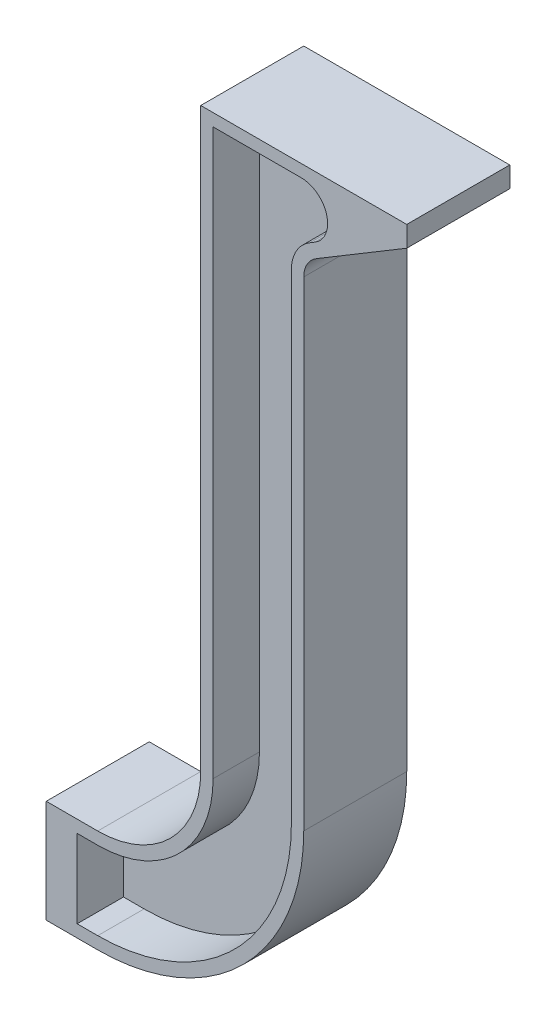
ISO-10303-21;
HEADER;
FILE_DESCRIPTION(('STEP AP214'),'2;1');
FILE_NAME('part.step','',(''),(''),'','','');
FILE_SCHEMA(('AUTOMOTIVE_DESIGN { 1 0 10303 214 1 1 1 1 }'));
ENDSEC;
DATA;
#1=APPLICATION_CONTEXT('core data for automotive mechanical design processes');
#2=APPLICATION_PROTOCOL_DEFINITION('international standard','automotive_design',2000,#1);
#3=PRODUCT_CONTEXT('',#1,'mechanical');
#4=PRODUCT('Part','Part','',(#3));
#5=PRODUCT_RELATED_PRODUCT_CATEGORY('part','',(#4));
#6=PRODUCT_DEFINITION_FORMATION('','',#4);
#7=PRODUCT_DEFINITION_CONTEXT('part definition',#1,'design');
#8=PRODUCT_DEFINITION('design','',#6,#7);
#9=PRODUCT_DEFINITION_SHAPE('','',#8);
#10=(LENGTH_UNIT() NAMED_UNIT(*) SI_UNIT(.MILLI.,.METRE.));
#11=(NAMED_UNIT(*) PLANE_ANGLE_UNIT() SI_UNIT($,.RADIAN.));
#12=(NAMED_UNIT(*) SI_UNIT($,.STERADIAN.) SOLID_ANGLE_UNIT());
#13=UNCERTAINTY_MEASURE_WITH_UNIT(LENGTH_MEASURE(1.E-05),#10,'distance_accuracy_value','');
#14=(GEOMETRIC_REPRESENTATION_CONTEXT(3) GLOBAL_UNCERTAINTY_ASSIGNED_CONTEXT((#13)) GLOBAL_UNIT_ASSIGNED_CONTEXT((#10,
#11,#12)) REPRESENTATION_CONTEXT('',''));
#15=CARTESIAN_POINT('',(0.,0.,0.));
#16=DIRECTION('',(0.,0.,1.));
#17=DIRECTION('',(1.,0.,0.));
#18=AXIS2_PLACEMENT_3D('',#15,#16,#17);
#19=CARTESIAN_POINT('',(15.875,-11.9576544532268,-6.35));
#20=DIRECTION('',(0.,0.,1.));
#21=DIRECTION('',(1.,0.,0.));
#22=AXIS2_PLACEMENT_3D('',#19,#20,#21);
#23=PLANE('',#22);
#24=DIRECTION('',(0.,1.,0.));
#25=VECTOR('',#24,1.);
#26=CARTESIAN_POINT('',(25.4,0.,-6.35));
#27=LINE('',#26,#25);
#28=CARTESIAN_POINT('',(25.4,-2.54,-6.35));
#29=VERTEX_POINT('',#28);
#30=CARTESIAN_POINT('',(25.4,0.,-6.35));
#31=VERTEX_POINT('',#30);
#32=EDGE_CURVE('E404',#29,#31,#27,.T.);
#33=ORIENTED_EDGE('',*,*,#32,.F.);
#34=DIRECTION('',(0.857492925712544,0.514495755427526,0.));
#35=VECTOR('',#34,1.);
#36=CARTESIAN_POINT('',(14.2414759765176,-9.23511441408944,-6.35));
#37=LINE('',#36,#35);
#38=CARTESIAN_POINT('',(14.2414759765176,-9.23511441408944,-6.35));
#39=VERTEX_POINT('',#38);
#40=EDGE_CURVE('E409',#39,#29,#37,.T.);
#41=ORIENTED_EDGE('',*,*,#40,.F.);
#42=CARTESIAN_POINT('',(15.875,-11.9576544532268,-6.35));
#43=DIRECTION('',(0.,0.,-1.));
#44=DIRECTION('',(1.,0.,0.));
#45=AXIS2_PLACEMENT_3D('',#42,#43,#44);
#46=CIRCLE('',#45,3.175);
#47=CARTESIAN_POINT('',(12.7,-11.9576544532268,-6.35));
#48=VERTEX_POINT('',#47);
#49=EDGE_CURVE('E448',#48,#39,#46,.T.);
#50=ORIENTED_EDGE('',*,*,#49,.F.);
#51=DIRECTION('',(0.,1.,0.));
#52=VECTOR('',#51,1.);
#53=CARTESIAN_POINT('',(12.7,-11.9576544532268,-6.35));
#54=LINE('',#53,#52);
#55=CARTESIAN_POINT('',(12.7,-71.12,-6.35));
#56=VERTEX_POINT('',#55);
#57=EDGE_CURVE('E446',#56,#48,#54,.T.);
#58=ORIENTED_EDGE('',*,*,#57,.F.);
#59=CARTESIAN_POINT('',(-12.7,-71.12,-6.35));
#60=DIRECTION('',(0.,0.,1.));
#61=DIRECTION('',(-1.,0.,0.));
#62=AXIS2_PLACEMENT_3D('',#59,#60,#61);
#63=CIRCLE('',#62,25.4);
#64=CARTESIAN_POINT('',(-12.7,-96.52,-6.35));
#65=VERTEX_POINT('',#64);
#66=EDGE_CURVE('E444',#65,#56,#63,.T.);
#67=ORIENTED_EDGE('',*,*,#66,.F.);
#68=DIRECTION('',(1.,0.,0.));
#69=VECTOR('',#68,1.);
#70=CARTESIAN_POINT('',(-12.7,-96.52,-6.35));
#71=LINE('',#70,#69);
#72=CARTESIAN_POINT('',(-19.05,-96.52,-6.35));
#73=VERTEX_POINT('',#72);
#74=EDGE_CURVE('E442',#73,#65,#71,.T.);
#75=ORIENTED_EDGE('',*,*,#74,.F.);
#76=DIRECTION('',(0.,-1.,0.));
#77=VECTOR('',#76,1.);
#78=CARTESIAN_POINT('',(-19.05,-96.52,-6.35));
#79=LINE('',#78,#77);
#80=CARTESIAN_POINT('',(-19.05,-83.82,-6.35));
#81=VERTEX_POINT('',#80);
#82=EDGE_CURVE('E440',#81,#73,#79,.T.);
#83=ORIENTED_EDGE('',*,*,#82,.F.);
#84=DIRECTION('',(-1.,0.,0.));
#85=VECTOR('',#84,1.);
#86=CARTESIAN_POINT('',(-12.7,-83.82,-6.35));
#87=LINE('',#86,#85);
#88=CARTESIAN_POINT('',(-12.7,-83.82,-6.35));
#89=VERTEX_POINT('',#88);
#90=EDGE_CURVE('E438',#89,#81,#87,.T.);
#91=ORIENTED_EDGE('',*,*,#90,.F.);
#92=CARTESIAN_POINT('',(-12.7,-71.12,-6.35));
#93=DIRECTION('',(0.,0.,-1.));
#94=DIRECTION('',(-1.,0.,0.));
#95=AXIS2_PLACEMENT_3D('',#92,#93,#94);
#96=CIRCLE('',#95,12.7);
#97=CARTESIAN_POINT('',(0.,-71.12,-6.35));
#98=VERTEX_POINT('',#97);
#99=EDGE_CURVE('E436',#98,#89,#96,.T.);
#100=ORIENTED_EDGE('',*,*,#99,.F.);
#101=DIRECTION('',(0.,-1.,0.));
#102=VECTOR('',#101,1.);
#103=CARTESIAN_POINT('',(0.,0.,-6.35));
#104=LINE('',#103,#102);
#105=CARTESIAN_POINT('',(0.,0.,-6.35));
#106=VERTEX_POINT('',#105);
#107=EDGE_CURVE('E434',#106,#98,#104,.T.);
#108=ORIENTED_EDGE('',*,*,#107,.F.);
#109=DIRECTION('',(-1.,0.,0.));
#110=VECTOR('',#109,1.);
#111=CARTESIAN_POINT('',(0.,0.,-6.35));
#112=LINE('',#111,#110);
#113=EDGE_CURVE('E432',#31,#106,#112,.T.);
#114=ORIENTED_EDGE('',*,*,#113,.F.);
#115=EDGE_LOOP('',(#33,#41,#50,#58,#67,#75,#83,#91,#100,#108,#114));
#116=FACE_BOUND('',#115,.T.);
#117=CARTESIAN_POINT('',(12.3933461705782,-4.7752,-6.35));
#118=DIRECTION('',(0.,0.,1.));
#119=DIRECTION('',(-1.,0.,0.));
#120=AXIS2_PLACEMENT_3D('',#117,#118,#119);
#121=CIRCLE('',#120,3.2512);
#122=CARTESIAN_POINT('',(14.0660747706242,-7.56308100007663,-6.35));
#123=VERTEX_POINT('',#122);
#124=CARTESIAN_POINT('',(12.3933461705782,-1.524,-6.35));
#125=VERTEX_POINT('',#124);
#126=EDGE_CURVE('E50',#123,#125,#121,.T.);
#127=ORIENTED_EDGE('',*,*,#126,.T.);
#128=DIRECTION('',(-1.,0.,0.));
#129=VECTOR('',#128,1.);
#130=CARTESIAN_POINT('',(12.3933461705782,-1.524,-6.35));
#131=LINE('',#130,#129);
#132=CARTESIAN_POINT('',(1.524,-1.524,-6.35));
#133=VERTEX_POINT('',#132);
#134=EDGE_CURVE('E306',#125,#133,#131,.T.);
#135=ORIENTED_EDGE('',*,*,#134,.T.);
#136=DIRECTION('',(0.,-1.,0.));
#137=VECTOR('',#136,1.);
#138=CARTESIAN_POINT('',(1.524,-1.524,-6.35));
#139=LINE('',#138,#137);
#140=CARTESIAN_POINT('',(1.52400000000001,-71.12,-6.35));
#141=VERTEX_POINT('',#140);
#142=EDGE_CURVE('E309',#133,#141,#139,.T.);
#143=ORIENTED_EDGE('',*,*,#142,.T.);
#144=CARTESIAN_POINT('',(-12.7,-71.12,-6.35));
#145=DIRECTION('',(0.,0.,-1.));
#146=DIRECTION('',(1.,0.,0.));
#147=AXIS2_PLACEMENT_3D('',#144,#145,#146);
#148=CIRCLE('',#147,14.224);
#149=CARTESIAN_POINT('',(-12.7,-85.344,-6.35));
#150=VERTEX_POINT('',#149);
#151=EDGE_CURVE('E312',#141,#150,#148,.T.);
#152=ORIENTED_EDGE('',*,*,#151,.T.);
#153=DIRECTION('',(-1.,0.,0.));
#154=VECTOR('',#153,1.);
#155=CARTESIAN_POINT('',(-12.7,-85.344,-6.35));
#156=LINE('',#155,#154);
#157=CARTESIAN_POINT('',(-15.24,-85.344,-6.35));
#158=VERTEX_POINT('',#157);
#159=EDGE_CURVE('E315',#150,#158,#156,.T.);
#160=ORIENTED_EDGE('',*,*,#159,.T.);
#161=DIRECTION('',(0.,-1.,0.));
#162=VECTOR('',#161,1.);
#163=CARTESIAN_POINT('',(-15.24,-85.344,-6.35));
#164=LINE('',#163,#162);
#165=CARTESIAN_POINT('',(-15.24,-94.996,-6.35));
#166=VERTEX_POINT('',#165);
#167=EDGE_CURVE('E318',#158,#166,#164,.T.);
#168=ORIENTED_EDGE('',*,*,#167,.T.);
#169=DIRECTION('',(1.,0.,0.));
#170=VECTOR('',#169,1.);
#171=CARTESIAN_POINT('',(-15.24,-94.996,-6.35));
#172=LINE('',#171,#170);
#173=CARTESIAN_POINT('',(-12.7,-94.996,-6.35));
#174=VERTEX_POINT('',#173);
#175=EDGE_CURVE('E321',#166,#174,#172,.T.);
#176=ORIENTED_EDGE('',*,*,#175,.T.);
#177=CARTESIAN_POINT('',(-12.7,-71.12,-6.35));
#178=DIRECTION('',(0.,0.,1.));
#179=DIRECTION('',(1.,0.,0.));
#180=AXIS2_PLACEMENT_3D('',#177,#178,#179);
#181=CIRCLE('',#180,23.876);
#182=CARTESIAN_POINT('',(11.176,-71.12,-6.35));
#183=VERTEX_POINT('',#182);
#184=EDGE_CURVE('E324',#174,#183,#181,.T.);
#185=ORIENTED_EDGE('',*,*,#184,.T.);
#186=DIRECTION('',(0.,1.,0.));
#187=VECTOR('',#186,1.);
#188=CARTESIAN_POINT('',(11.176,-71.12,-6.35));
#189=LINE('',#188,#187);
#190=CARTESIAN_POINT('',(11.176,-11.9576544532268,-6.35));
#191=VERTEX_POINT('',#190);
#192=EDGE_CURVE('E327',#183,#191,#189,.T.);
#193=ORIENTED_EDGE('',*,*,#192,.T.);
#194=CARTESIAN_POINT('',(15.875,-11.9576544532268,-6.35));
#195=DIRECTION('',(0.,0.,-1.));
#196=DIRECTION('',(1.,0.,0.));
#197=AXIS2_PLACEMENT_3D('',#194,#195,#196);
#198=CIRCLE('',#197,4.699);
#199=CARTESIAN_POINT('',(13.4573844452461,-7.92829519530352,-6.35));
#200=VERTEX_POINT('',#199);
#201=EDGE_CURVE('E261',#191,#200,#198,.T.);
#202=ORIENTED_EDGE('',*,*,#201,.T.);
#203=DIRECTION('',(0.857492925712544,0.514495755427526,0.));
#204=VECTOR('',#203,1.);
#205=CARTESIAN_POINT('',(13.4573844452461,-7.92829519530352,-6.35));
#206=LINE('',#205,#204);
#207=EDGE_CURVE('E256',#200,#123,#206,.T.);
#208=ORIENTED_EDGE('',*,*,#207,.T.);
#209=EDGE_LOOP('',(#127,#135,#143,#152,#160,#168,#176,#185,#193,#202,#208));
#210=FACE_BOUND('',#209,.T.);
#211=ADVANCED_FACE('F35',(#116,#210),#23,.F.);
#212=CARTESIAN_POINT('',(25.4,0.,6.35));
#213=DIRECTION('',(-1.,0.,0.));
#214=DIRECTION('',(0.,0.,1.));
#215=AXIS2_PLACEMENT_3D('',#212,#213,#214);
#216=PLANE('',#215);
#217=ORIENTED_EDGE('',*,*,#32,.T.);
#218=DIRECTION('',(0.,0.,-1.));
#219=VECTOR('',#218,1.);
#220=CARTESIAN_POINT('',(25.4,0.,6.35));
#221=LINE('',#220,#219);
#222=CARTESIAN_POINT('',(25.4,0.,6.35));
#223=VERTEX_POINT('',#222);
#224=EDGE_CURVE('E12',#223,#31,#221,.T.);
#225=ORIENTED_EDGE('',*,*,#224,.F.);
#226=DIRECTION('',(0.,1.,0.));
#227=VECTOR('',#226,1.);
#228=CARTESIAN_POINT('',(25.4,0.,6.35));
#229=LINE('',#228,#227);
#230=CARTESIAN_POINT('',(25.4,-2.54,6.35));
#231=VERTEX_POINT('',#230);
#232=EDGE_CURVE('E405',#231,#223,#229,.T.);
#233=ORIENTED_EDGE('',*,*,#232,.F.);
#234=DIRECTION('',(0.,0.,-1.));
#235=VECTOR('',#234,1.);
#236=CARTESIAN_POINT('',(25.4,-2.54,6.35));
#237=LINE('',#236,#235);
#238=EDGE_CURVE('E429',#231,#29,#237,.T.);
#239=ORIENTED_EDGE('',*,*,#238,.T.);
#240=EDGE_LOOP('',(#217,#225,#233,#239));
#241=FACE_BOUND('',#240,.T.);
#242=ADVANCED_FACE('F37',(#241),#216,.F.);
#243=CARTESIAN_POINT('',(0.,0.,6.35));
#244=DIRECTION('',(0.,-1.,0.));
#245=DIRECTION('',(0.,0.,-1.));
#246=AXIS2_PLACEMENT_3D('',#243,#244,#245);
#247=PLANE('',#246);
#248=ORIENTED_EDGE('',*,*,#113,.T.);
#249=DIRECTION('',(0.,0.,-1.));
#250=VECTOR('',#249,1.);
#251=CARTESIAN_POINT('',(0.,0.,6.35));
#252=LINE('',#251,#250);
#253=CARTESIAN_POINT('',(0.,0.,6.35));
#254=VERTEX_POINT('',#253);
#255=EDGE_CURVE('E43',#254,#106,#252,.T.);
#256=ORIENTED_EDGE('',*,*,#255,.F.);
#257=DIRECTION('',(-1.,0.,0.));
#258=VECTOR('',#257,1.);
#259=CARTESIAN_POINT('',(0.,0.,6.35));
#260=LINE('',#259,#258);
#261=EDGE_CURVE('E408',#223,#254,#260,.T.);
#262=ORIENTED_EDGE('',*,*,#261,.F.);
#263=ORIENTED_EDGE('',*,*,#224,.T.);
#264=EDGE_LOOP('',(#248,#256,#262,#263));
#265=FACE_BOUND('',#264,.T.);
#266=ADVANCED_FACE('F504',(#265),#247,.F.);
#267=CARTESIAN_POINT('',(0.,0.,6.35));
#268=DIRECTION('',(1.,0.,0.));
#269=DIRECTION('',(0.,1.,0.));
#270=AXIS2_PLACEMENT_3D('',#267,#268,#269);
#271=PLANE('',#270);
#272=ORIENTED_EDGE('',*,*,#107,.T.);
#273=DIRECTION('',(0.,0.,-1.));
#274=VECTOR('',#273,1.);
#275=CARTESIAN_POINT('',(0.,-71.12,6.35));
#276=LINE('',#275,#274);
#277=CARTESIAN_POINT('',(0.,-71.12,6.35));
#278=VERTEX_POINT('',#277);
#279=EDGE_CURVE('E474',#278,#98,#276,.T.);
#280=ORIENTED_EDGE('',*,*,#279,.F.);
#281=DIRECTION('',(0.,-1.,0.));
#282=VECTOR('',#281,1.);
#283=CARTESIAN_POINT('',(0.,0.,6.35));
#284=LINE('',#283,#282);
#285=EDGE_CURVE('E411',#254,#278,#284,.T.);
#286=ORIENTED_EDGE('',*,*,#285,.F.);
#287=ORIENTED_EDGE('',*,*,#255,.T.);
#288=EDGE_LOOP('',(#272,#280,#286,#287));
#289=FACE_BOUND('',#288,.T.);
#290=ADVANCED_FACE('F481',(#289),#271,.F.);
#291=CARTESIAN_POINT('',(-12.7,-71.12,6.35));
#292=DIRECTION('',(0.,0.,-1.));
#293=DIRECTION('',(-1.,0.,0.));
#294=AXIS2_PLACEMENT_3D('',#291,#292,#293);
#295=CYLINDRICAL_SURFACE('',#294,12.7);
#296=ORIENTED_EDGE('',*,*,#99,.T.);
#297=DIRECTION('',(0.,0.,-1.));
#298=VECTOR('',#297,1.);
#299=CARTESIAN_POINT('',(-12.7,-83.82,6.35));
#300=LINE('',#299,#298);
#301=CARTESIAN_POINT('',(-12.7,-83.82,6.35));
#302=VERTEX_POINT('',#301);
#303=EDGE_CURVE('E471',#302,#89,#300,.T.);
#304=ORIENTED_EDGE('',*,*,#303,.F.);
#305=CARTESIAN_POINT('',(-12.7,-71.12,6.35));
#306=DIRECTION('',(0.,0.,-1.));
#307=DIRECTION('',(-1.,0.,0.));
#308=AXIS2_PLACEMENT_3D('',#305,#306,#307);
#309=CIRCLE('',#308,12.7);
#310=EDGE_CURVE('E413',#278,#302,#309,.T.);
#311=ORIENTED_EDGE('',*,*,#310,.F.);
#312=ORIENTED_EDGE('',*,*,#279,.T.);
#313=EDGE_LOOP('',(#296,#304,#311,#312));
#314=FACE_BOUND('',#313,.T.);
#315=ADVANCED_FACE('F492',(#314),#295,.F.);
#316=CARTESIAN_POINT('',(-12.7,-83.82,6.35));
#317=DIRECTION('',(0.,-1.,0.));
#318=DIRECTION('',(0.,0.,-1.));
#319=AXIS2_PLACEMENT_3D('',#316,#317,#318);
#320=PLANE('',#319);
#321=ORIENTED_EDGE('',*,*,#90,.T.);
#322=DIRECTION('',(0.,0.,-1.));
#323=VECTOR('',#322,1.);
#324=CARTESIAN_POINT('',(-19.05,-83.82,6.35));
#325=LINE('',#324,#323);
#326=CARTESIAN_POINT('',(-19.05,-83.82,6.35));
#327=VERTEX_POINT('',#326);
#328=EDGE_CURVE('E468',#327,#81,#325,.T.);
#329=ORIENTED_EDGE('',*,*,#328,.F.);
#330=DIRECTION('',(-1.,0.,0.));
#331=VECTOR('',#330,1.);
#332=CARTESIAN_POINT('',(-12.7,-83.82,6.35));
#333=LINE('',#332,#331);
#334=EDGE_CURVE('E415',#302,#327,#333,.T.);
#335=ORIENTED_EDGE('',*,*,#334,.F.);
#336=ORIENTED_EDGE('',*,*,#303,.T.);
#337=EDGE_LOOP('',(#321,#329,#335,#336));
#338=FACE_BOUND('',#337,.T.);
#339=ADVANCED_FACE('F496',(#338),#320,.F.);
#340=CARTESIAN_POINT('',(-19.05,-96.52,6.35));
#341=DIRECTION('',(1.,0.,0.));
#342=DIRECTION('',(0.,1.,0.));
#343=AXIS2_PLACEMENT_3D('',#340,#341,#342);
#344=PLANE('',#343);
#345=ORIENTED_EDGE('',*,*,#82,.T.);
#346=DIRECTION('',(0.,0.,-1.));
#347=VECTOR('',#346,1.);
#348=CARTESIAN_POINT('',(-19.05,-96.52,6.35));
#349=LINE('',#348,#347);
#350=CARTESIAN_POINT('',(-19.05,-96.52,6.35));
#351=VERTEX_POINT('',#350);
#352=EDGE_CURVE('E465',#351,#73,#349,.T.);
#353=ORIENTED_EDGE('',*,*,#352,.F.);
#354=DIRECTION('',(0.,-1.,0.));
#355=VECTOR('',#354,1.);
#356=CARTESIAN_POINT('',(-19.05,-96.52,6.35));
#357=LINE('',#356,#355);
#358=EDGE_CURVE('E417',#327,#351,#357,.T.);
#359=ORIENTED_EDGE('',*,*,#358,.F.);
#360=ORIENTED_EDGE('',*,*,#328,.T.);
#361=EDGE_LOOP('',(#345,#353,#359,#360));
#362=FACE_BOUND('',#361,.T.);
#363=ADVANCED_FACE('F532',(#362),#344,.F.);
#364=CARTESIAN_POINT('',(-12.7,-96.52,6.35));
#365=DIRECTION('',(0.,1.,0.));
#366=DIRECTION('',(0.,0.,1.));
#367=AXIS2_PLACEMENT_3D('',#364,#365,#366);
#368=PLANE('',#367);
#369=ORIENTED_EDGE('',*,*,#74,.T.);
#370=DIRECTION('',(0.,0.,-1.));
#371=VECTOR('',#370,1.);
#372=CARTESIAN_POINT('',(-12.7,-96.52,6.35));
#373=LINE('',#372,#371);
#374=CARTESIAN_POINT('',(-12.7,-96.52,6.35));
#375=VERTEX_POINT('',#374);
#376=EDGE_CURVE('E462',#375,#65,#373,.T.);
#377=ORIENTED_EDGE('',*,*,#376,.F.);
#378=DIRECTION('',(1.,0.,0.));
#379=VECTOR('',#378,1.);
#380=CARTESIAN_POINT('',(-12.7,-96.52,6.35));
#381=LINE('',#380,#379);
#382=EDGE_CURVE('E419',#351,#375,#381,.T.);
#383=ORIENTED_EDGE('',*,*,#382,.F.);
#384=ORIENTED_EDGE('',*,*,#352,.T.);
#385=EDGE_LOOP('',(#369,#377,#383,#384));
#386=FACE_BOUND('',#385,.T.);
#387=ADVANCED_FACE('F530',(#386),#368,.F.);
#388=CARTESIAN_POINT('',(-12.7,-71.12,6.35));
#389=DIRECTION('',(0.,0.,-1.));
#390=DIRECTION('',(-1.,0.,0.));
#391=AXIS2_PLACEMENT_3D('',#388,#389,#390);
#392=CYLINDRICAL_SURFACE('',#391,25.4);
#393=ORIENTED_EDGE('',*,*,#66,.T.);
#394=DIRECTION('',(0.,0.,-1.));
#395=VECTOR('',#394,1.);
#396=CARTESIAN_POINT('',(12.7,-71.12,6.35));
#397=LINE('',#396,#395);
#398=CARTESIAN_POINT('',(12.7,-71.12,6.35));
#399=VERTEX_POINT('',#398);
#400=EDGE_CURVE('E459',#399,#56,#397,.T.);
#401=ORIENTED_EDGE('',*,*,#400,.F.);
#402=CARTESIAN_POINT('',(-12.7,-71.12,6.35));
#403=DIRECTION('',(0.,0.,1.));
#404=DIRECTION('',(-1.,0.,0.));
#405=AXIS2_PLACEMENT_3D('',#402,#403,#404);
#406=CIRCLE('',#405,25.4);
#407=EDGE_CURVE('E421',#375,#399,#406,.T.);
#408=ORIENTED_EDGE('',*,*,#407,.F.);
#409=ORIENTED_EDGE('',*,*,#376,.T.);
#410=EDGE_LOOP('',(#393,#401,#408,#409));
#411=FACE_BOUND('',#410,.T.);
#412=ADVANCED_FACE('F525',(#411),#392,.T.);
#413=CARTESIAN_POINT('',(12.7,-11.9576544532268,6.35));
#414=DIRECTION('',(-1.,0.,0.));
#415=DIRECTION('',(0.,-1.,0.));
#416=AXIS2_PLACEMENT_3D('',#413,#414,#415);
#417=PLANE('',#416);
#418=ORIENTED_EDGE('',*,*,#57,.T.);
#419=DIRECTION('',(0.,0.,-1.));
#420=VECTOR('',#419,1.);
#421=CARTESIAN_POINT('',(12.7,-11.9576544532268,6.35));
#422=LINE('',#421,#420);
#423=CARTESIAN_POINT('',(12.7,-11.9576544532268,6.35));
#424=VERTEX_POINT('',#423);
#425=EDGE_CURVE('E456',#424,#48,#422,.T.);
#426=ORIENTED_EDGE('',*,*,#425,.F.);
#427=DIRECTION('',(0.,1.,0.));
#428=VECTOR('',#427,1.);
#429=CARTESIAN_POINT('',(12.7,-11.9576544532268,6.35));
#430=LINE('',#429,#428);
#431=EDGE_CURVE('E423',#399,#424,#430,.T.);
#432=ORIENTED_EDGE('',*,*,#431,.F.);
#433=ORIENTED_EDGE('',*,*,#400,.T.);
#434=EDGE_LOOP('',(#418,#426,#432,#433));
#435=FACE_BOUND('',#434,.T.);
#436=ADVANCED_FACE('F520',(#435),#417,.F.);
#437=CARTESIAN_POINT('',(15.875,-11.9576544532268,6.35));
#438=DIRECTION('',(0.,0.,-1.));
#439=DIRECTION('',(-1.,0.,0.));
#440=AXIS2_PLACEMENT_3D('',#437,#438,#439);
#441=CYLINDRICAL_SURFACE('',#440,3.175);
#442=ORIENTED_EDGE('',*,*,#49,.T.);
#443=DIRECTION('',(0.,0.,-1.));
#444=VECTOR('',#443,1.);
#445=CARTESIAN_POINT('',(14.2414759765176,-9.23511441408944,6.35));
#446=LINE('',#445,#444);
#447=CARTESIAN_POINT('',(14.2414759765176,-9.23511441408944,6.35));
#448=VERTEX_POINT('',#447);
#449=EDGE_CURVE('E453',#448,#39,#446,.T.);
#450=ORIENTED_EDGE('',*,*,#449,.F.);
#451=CARTESIAN_POINT('',(15.875,-11.9576544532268,6.35));
#452=DIRECTION('',(0.,0.,-1.));
#453=DIRECTION('',(1.,0.,0.));
#454=AXIS2_PLACEMENT_3D('',#451,#452,#453);
#455=CIRCLE('',#454,3.175);
#456=EDGE_CURVE('E425',#424,#448,#455,.T.);
#457=ORIENTED_EDGE('',*,*,#456,.F.);
#458=ORIENTED_EDGE('',*,*,#425,.T.);
#459=EDGE_LOOP('',(#442,#450,#457,#458));
#460=FACE_BOUND('',#459,.T.);
#461=ADVANCED_FACE('F516',(#460),#441,.F.);
#462=CARTESIAN_POINT('',(14.2414759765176,-9.23511441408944,6.35));
#463=DIRECTION('',(-0.514495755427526,0.857492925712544,0.));
#464=DIRECTION('',(-0.857492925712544,-0.514495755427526,0.));
#465=AXIS2_PLACEMENT_3D('',#462,#463,#464);
#466=PLANE('',#465);
#467=ORIENTED_EDGE('',*,*,#40,.T.);
#468=ORIENTED_EDGE('',*,*,#238,.F.);
#469=DIRECTION('',(0.857492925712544,0.514495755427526,0.));
#470=VECTOR('',#469,1.);
#471=CARTESIAN_POINT('',(14.2414759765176,-9.23511441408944,6.35));
#472=LINE('',#471,#470);
#473=EDGE_CURVE('E427',#448,#231,#472,.T.);
#474=ORIENTED_EDGE('',*,*,#473,.F.);
#475=ORIENTED_EDGE('',*,*,#449,.T.);
#476=EDGE_LOOP('',(#467,#468,#474,#475));
#477=FACE_BOUND('',#476,.T.);
#478=ADVANCED_FACE('F511',(#477),#466,.F.);
#479=CARTESIAN_POINT('',(15.875,-11.9576544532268,6.35));
#480=DIRECTION('',(0.,0.,1.));
#481=DIRECTION('',(1.,0.,0.));
#482=AXIS2_PLACEMENT_3D('',#479,#480,#481);
#483=PLANE('',#482);
#484=CARTESIAN_POINT('',(12.3933461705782,-4.7752,6.35));
#485=DIRECTION('',(0.,0.,1.));
#486=DIRECTION('',(-1.,0.,0.));
#487=AXIS2_PLACEMENT_3D('',#484,#485,#486);
#488=CIRCLE('',#487,3.2512);
#489=CARTESIAN_POINT('',(14.0660747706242,-7.56308100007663,6.35));
#490=VERTEX_POINT('',#489);
#491=CARTESIAN_POINT('',(12.3933461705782,-1.524,6.35));
#492=VERTEX_POINT('',#491);
#493=EDGE_CURVE('E58',#490,#492,#488,.T.);
#494=ORIENTED_EDGE('',*,*,#493,.F.);
#495=DIRECTION('',(0.857492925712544,0.514495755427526,0.));
#496=VECTOR('',#495,1.);
#497=CARTESIAN_POINT('',(13.4573844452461,-7.92829519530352,6.35));
#498=LINE('',#497,#496);
#499=CARTESIAN_POINT('',(13.4573844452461,-7.92829519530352,6.35));
#500=VERTEX_POINT('',#499);
#501=EDGE_CURVE('E379',#500,#490,#498,.T.);
#502=ORIENTED_EDGE('',*,*,#501,.F.);
#503=CARTESIAN_POINT('',(15.875,-11.9576544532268,6.35));
#504=DIRECTION('',(0.,0.,-1.));
#505=DIRECTION('',(1.,0.,0.));
#506=AXIS2_PLACEMENT_3D('',#503,#504,#505);
#507=CIRCLE('',#506,4.699);
#508=CARTESIAN_POINT('',(11.176,-11.9576544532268,6.35));
#509=VERTEX_POINT('',#508);
#510=EDGE_CURVE('E376',#509,#500,#507,.T.);
#511=ORIENTED_EDGE('',*,*,#510,.F.);
#512=DIRECTION('',(0.,1.,0.));
#513=VECTOR('',#512,1.);
#514=CARTESIAN_POINT('',(11.176,-71.12,6.35));
#515=LINE('',#514,#513);
#516=CARTESIAN_POINT('',(11.176,-71.12,6.35));
#517=VERTEX_POINT('',#516);
#518=EDGE_CURVE('E373',#517,#509,#515,.T.);
#519=ORIENTED_EDGE('',*,*,#518,.F.);
#520=CARTESIAN_POINT('',(-12.7,-71.12,6.35));
#521=DIRECTION('',(0.,0.,1.));
#522=DIRECTION('',(1.,0.,0.));
#523=AXIS2_PLACEMENT_3D('',#520,#521,#522);
#524=CIRCLE('',#523,23.876);
#525=CARTESIAN_POINT('',(-12.7,-94.996,6.35));
#526=VERTEX_POINT('',#525);
#527=EDGE_CURVE('E370',#526,#517,#524,.T.);
#528=ORIENTED_EDGE('',*,*,#527,.F.);
#529=DIRECTION('',(1.,0.,0.));
#530=VECTOR('',#529,1.);
#531=CARTESIAN_POINT('',(-15.24,-94.996,6.35));
#532=LINE('',#531,#530);
#533=CARTESIAN_POINT('',(-15.24,-94.996,6.35));
#534=VERTEX_POINT('',#533);
#535=EDGE_CURVE('E367',#534,#526,#532,.T.);
#536=ORIENTED_EDGE('',*,*,#535,.F.);
#537=DIRECTION('',(0.,-1.,0.));
#538=VECTOR('',#537,1.);
#539=CARTESIAN_POINT('',(-15.24,-85.344,6.35));
#540=LINE('',#539,#538);
#541=CARTESIAN_POINT('',(-15.24,-85.344,6.35));
#542=VERTEX_POINT('',#541);
#543=EDGE_CURVE('E364',#542,#534,#540,.T.);
#544=ORIENTED_EDGE('',*,*,#543,.F.);
#545=DIRECTION('',(-1.,0.,0.));
#546=VECTOR('',#545,1.);
#547=CARTESIAN_POINT('',(-12.7,-85.344,6.35));
#548=LINE('',#547,#546);
#549=CARTESIAN_POINT('',(-12.7,-85.344,6.35));
#550=VERTEX_POINT('',#549);
#551=EDGE_CURVE('E361',#550,#542,#548,.T.);
#552=ORIENTED_EDGE('',*,*,#551,.F.);
#553=CARTESIAN_POINT('',(-12.7,-71.12,6.35));
#554=DIRECTION('',(0.,0.,-1.));
#555=DIRECTION('',(1.,0.,0.));
#556=AXIS2_PLACEMENT_3D('',#553,#554,#555);
#557=CIRCLE('',#556,14.224);
#558=CARTESIAN_POINT('',(1.52400000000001,-71.12,6.35));
#559=VERTEX_POINT('',#558);
#560=EDGE_CURVE('E358',#559,#550,#557,.T.);
#561=ORIENTED_EDGE('',*,*,#560,.F.);
#562=DIRECTION('',(0.,-1.,0.));
#563=VECTOR('',#562,1.);
#564=CARTESIAN_POINT('',(1.524,-1.524,6.35));
#565=LINE('',#564,#563);
#566=CARTESIAN_POINT('',(1.524,-1.524,6.35));
#567=VERTEX_POINT('',#566);
#568=EDGE_CURVE('E355',#567,#559,#565,.T.);
#569=ORIENTED_EDGE('',*,*,#568,.F.);
#570=DIRECTION('',(-1.,0.,0.));
#571=VECTOR('',#570,1.);
#572=CARTESIAN_POINT('',(12.3933461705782,-1.524,6.35));
#573=LINE('',#572,#571);
#574=EDGE_CURVE('E276',#492,#567,#573,.T.);
#575=ORIENTED_EDGE('',*,*,#574,.F.);
#576=EDGE_LOOP('',(#494,#502,#511,#519,#528,#536,#544,#552,#561,#569,#575));
#577=FACE_BOUND('',#576,.T.);
#578=ORIENTED_EDGE('',*,*,#232,.T.);
#579=ORIENTED_EDGE('',*,*,#261,.T.);
#580=ORIENTED_EDGE('',*,*,#285,.T.);
#581=ORIENTED_EDGE('',*,*,#310,.T.);
#582=ORIENTED_EDGE('',*,*,#334,.T.);
#583=ORIENTED_EDGE('',*,*,#358,.T.);
#584=ORIENTED_EDGE('',*,*,#382,.T.);
#585=ORIENTED_EDGE('',*,*,#407,.T.);
#586=ORIENTED_EDGE('',*,*,#431,.T.);
#587=ORIENTED_EDGE('',*,*,#456,.T.);
#588=ORIENTED_EDGE('',*,*,#473,.T.);
#589=EDGE_LOOP('',(#578,#579,#580,#581,#582,#583,#584,#585,#586,#587,#588));
#590=FACE_BOUND('',#589,.T.);
#591=ADVANCED_FACE('F500',(#577,#590),#483,.T.);
#592=CARTESIAN_POINT('',(12.3933461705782,-4.7752,-98.4422164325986));
#593=DIRECTION('',(0.,0.,1.));
#594=DIRECTION('',(1.,0.,0.));
#595=AXIS2_PLACEMENT_3D('',#592,#593,#594);
#596=CYLINDRICAL_SURFACE('',#595,3.2512);
#597=CARTESIAN_POINT('',(12.3933461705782,-4.7752,0.634999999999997));
#598=DIRECTION('',(0.,0.,1.));
#599=DIRECTION('',(1.,0.,0.));
#600=AXIS2_PLACEMENT_3D('',#597,#598,#599);
#601=CIRCLE('',#600,3.2512);
#602=CARTESIAN_POINT('',(12.3933461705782,-1.524,0.634999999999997));
#603=VERTEX_POINT('',#602);
#604=CARTESIAN_POINT('',(14.0660747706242,-7.56308100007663,0.634999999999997));
#605=VERTEX_POINT('',#604);
#606=EDGE_CURVE('E350',#603,#605,#601,.F.);
#607=ORIENTED_EDGE('',*,*,#606,.T.);
#608=DIRECTION('',(0.,0.,1.));
#609=VECTOR('',#608,1.);
#610=CARTESIAN_POINT('',(14.0660747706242,-7.56308100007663,-98.4422164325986));
#611=LINE('',#610,#609);
#612=EDGE_CURVE('E334',#605,#490,#611,.T.);
#613=ORIENTED_EDGE('',*,*,#612,.T.);
#614=ORIENTED_EDGE('',*,*,#493,.T.);
#615=DIRECTION('',(0.,0.,1.));
#616=VECTOR('',#615,1.);
#617=CARTESIAN_POINT('',(12.3933461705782,-1.524,-98.4422164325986));
#618=LINE('',#617,#616);
#619=EDGE_CURVE('E382',#603,#492,#618,.T.);
#620=ORIENTED_EDGE('',*,*,#619,.F.);
#621=EDGE_LOOP('',(#607,#613,#614,#620));
#622=FACE_BOUND('',#621,.T.);
#623=ADVANCED_FACE('F578',(#622),#596,.F.);
#624=CARTESIAN_POINT('',(13.4573844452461,-7.92829519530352,-98.4422164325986));
#625=DIRECTION('',(0.514495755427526,-0.857492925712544,0.));
#626=DIRECTION('',(0.857492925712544,0.514495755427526,0.));
#627=AXIS2_PLACEMENT_3D('',#624,#625,#626);
#628=PLANE('',#627);
#629=DIRECTION('',(-0.857492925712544,-0.514495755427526,0.));
#630=VECTOR('',#629,1.);
#631=CARTESIAN_POINT('',(13.4573844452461,-7.92829519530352,0.634999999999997));
#632=LINE('',#631,#630);
#633=CARTESIAN_POINT('',(13.4573844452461,-7.92829519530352,0.634999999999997));
#634=VERTEX_POINT('',#633);
#635=EDGE_CURVE('E348',#605,#634,#632,.T.);
#636=ORIENTED_EDGE('',*,*,#635,.T.);
#637=DIRECTION('',(0.,0.,1.));
#638=VECTOR('',#637,1.);
#639=CARTESIAN_POINT('',(13.4573844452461,-7.92829519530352,-98.4422164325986));
#640=LINE('',#639,#638);
#641=EDGE_CURVE('E384',#634,#500,#640,.T.);
#642=ORIENTED_EDGE('',*,*,#641,.T.);
#643=ORIENTED_EDGE('',*,*,#501,.T.);
#644=ORIENTED_EDGE('',*,*,#612,.F.);
#645=EDGE_LOOP('',(#636,#642,#643,#644));
#646=FACE_BOUND('',#645,.T.);
#647=ADVANCED_FACE('F585',(#646),#628,.F.);
#648=CARTESIAN_POINT('',(15.875,-11.9576544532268,-98.4422164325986));
#649=DIRECTION('',(0.,0.,1.));
#650=DIRECTION('',(1.,0.,0.));
#651=AXIS2_PLACEMENT_3D('',#648,#649,#650);
#652=CYLINDRICAL_SURFACE('',#651,4.699);
#653=CARTESIAN_POINT('',(15.875,-11.9576544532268,0.634999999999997));
#654=DIRECTION('',(0.,0.,1.));
#655=DIRECTION('',(1.,0.,0.));
#656=AXIS2_PLACEMENT_3D('',#653,#654,#655);
#657=CIRCLE('',#656,4.699);
#658=CARTESIAN_POINT('',(11.176,-11.9576544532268,0.634999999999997));
#659=VERTEX_POINT('',#658);
#660=EDGE_CURVE('E346',#634,#659,#657,.T.);
#661=ORIENTED_EDGE('',*,*,#660,.T.);
#662=DIRECTION('',(0.,0.,1.));
#663=VECTOR('',#662,1.);
#664=CARTESIAN_POINT('',(11.176,-11.9576544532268,-98.4422164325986));
#665=LINE('',#664,#663);
#666=EDGE_CURVE('E386',#659,#509,#665,.T.);
#667=ORIENTED_EDGE('',*,*,#666,.T.);
#668=ORIENTED_EDGE('',*,*,#510,.T.);
#669=ORIENTED_EDGE('',*,*,#641,.F.);
#670=EDGE_LOOP('',(#661,#667,#668,#669));
#671=FACE_BOUND('',#670,.T.);
#672=ADVANCED_FACE('F591',(#671),#652,.T.);
#673=CARTESIAN_POINT('',(11.176,-71.12,-98.4422164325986));
#674=DIRECTION('',(1.,0.,0.));
#675=DIRECTION('',(0.,1.,0.));
#676=AXIS2_PLACEMENT_3D('',#673,#674,#675);
#677=PLANE('',#676);
#678=DIRECTION('',(0.,-1.,0.));
#679=VECTOR('',#678,1.);
#680=CARTESIAN_POINT('',(11.176,-71.12,0.634999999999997));
#681=LINE('',#680,#679);
#682=CARTESIAN_POINT('',(11.176,-71.12,0.634999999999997));
#683=VERTEX_POINT('',#682);
#684=EDGE_CURVE('E344',#659,#683,#681,.T.);
#685=ORIENTED_EDGE('',*,*,#684,.T.);
#686=DIRECTION('',(0.,0.,1.));
#687=VECTOR('',#686,1.);
#688=CARTESIAN_POINT('',(11.176,-71.12,-98.4422164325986));
#689=LINE('',#688,#687);
#690=EDGE_CURVE('E388',#683,#517,#689,.T.);
#691=ORIENTED_EDGE('',*,*,#690,.T.);
#692=ORIENTED_EDGE('',*,*,#518,.T.);
#693=ORIENTED_EDGE('',*,*,#666,.F.);
#694=EDGE_LOOP('',(#685,#691,#692,#693));
#695=FACE_BOUND('',#694,.T.);
#696=ADVANCED_FACE('F599',(#695),#677,.F.);
#697=CARTESIAN_POINT('',(-12.7,-71.12,-98.4422164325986));
#698=DIRECTION('',(0.,0.,1.));
#699=DIRECTION('',(1.,0.,0.));
#700=AXIS2_PLACEMENT_3D('',#697,#698,#699);
#701=CYLINDRICAL_SURFACE('',#700,23.876);
#702=CARTESIAN_POINT('',(-12.7,-71.12,0.634999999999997));
#703=DIRECTION('',(0.,0.,1.));
#704=DIRECTION('',(1.,0.,0.));
#705=AXIS2_PLACEMENT_3D('',#702,#703,#704);
#706=CIRCLE('',#705,23.876);
#707=CARTESIAN_POINT('',(-12.7,-94.996,0.634999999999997));
#708=VERTEX_POINT('',#707);
#709=EDGE_CURVE('E342',#683,#708,#706,.F.);
#710=ORIENTED_EDGE('',*,*,#709,.T.);
#711=DIRECTION('',(0.,0.,1.));
#712=VECTOR('',#711,1.);
#713=CARTESIAN_POINT('',(-12.7,-94.996,-98.4422164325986));
#714=LINE('',#713,#712);
#715=EDGE_CURVE('E390',#708,#526,#714,.T.);
#716=ORIENTED_EDGE('',*,*,#715,.T.);
#717=ORIENTED_EDGE('',*,*,#527,.T.);
#718=ORIENTED_EDGE('',*,*,#690,.F.);
#719=EDGE_LOOP('',(#710,#716,#717,#718));
#720=FACE_BOUND('',#719,.T.);
#721=ADVANCED_FACE('F607',(#720),#701,.F.);
#722=CARTESIAN_POINT('',(-15.24,-94.996,-98.4422164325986));
#723=DIRECTION('',(0.,-1.,0.));
#724=DIRECTION('',(0.,0.,-1.));
#725=AXIS2_PLACEMENT_3D('',#722,#723,#724);
#726=PLANE('',#725);
#727=DIRECTION('',(-1.,0.,0.));
#728=VECTOR('',#727,1.);
#729=CARTESIAN_POINT('',(-15.24,-94.996,0.634999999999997));
#730=LINE('',#729,#728);
#731=CARTESIAN_POINT('',(-15.24,-94.996,0.634999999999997));
#732=VERTEX_POINT('',#731);
#733=EDGE_CURVE('E340',#708,#732,#730,.T.);
#734=ORIENTED_EDGE('',*,*,#733,.T.);
#735=DIRECTION('',(0.,0.,1.));
#736=VECTOR('',#735,1.);
#737=CARTESIAN_POINT('',(-15.24,-94.996,-98.4422164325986));
#738=LINE('',#737,#736);
#739=EDGE_CURVE('E392',#732,#534,#738,.T.);
#740=ORIENTED_EDGE('',*,*,#739,.T.);
#741=ORIENTED_EDGE('',*,*,#535,.T.);
#742=ORIENTED_EDGE('',*,*,#715,.F.);
#743=EDGE_LOOP('',(#734,#740,#741,#742));
#744=FACE_BOUND('',#743,.T.);
#745=ADVANCED_FACE('F615',(#744),#726,.F.);
#746=CARTESIAN_POINT('',(-15.24,-85.344,-98.4422164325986));
#747=DIRECTION('',(-1.,0.,0.));
#748=DIRECTION('',(0.,-1.,0.));
#749=AXIS2_PLACEMENT_3D('',#746,#747,#748);
#750=PLANE('',#749);
#751=DIRECTION('',(0.,1.,0.));
#752=VECTOR('',#751,1.);
#753=CARTESIAN_POINT('',(-15.24,-85.344,0.634999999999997));
#754=LINE('',#753,#752);
#755=CARTESIAN_POINT('',(-15.24,-85.344,0.634999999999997));
#756=VERTEX_POINT('',#755);
#757=EDGE_CURVE('E338',#732,#756,#754,.T.);
#758=ORIENTED_EDGE('',*,*,#757,.T.);
#759=DIRECTION('',(0.,0.,1.));
#760=VECTOR('',#759,1.);
#761=CARTESIAN_POINT('',(-15.24,-85.344,-98.4422164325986));
#762=LINE('',#761,#760);
#763=EDGE_CURVE('E394',#756,#542,#762,.T.);
#764=ORIENTED_EDGE('',*,*,#763,.T.);
#765=ORIENTED_EDGE('',*,*,#543,.T.);
#766=ORIENTED_EDGE('',*,*,#739,.F.);
#767=EDGE_LOOP('',(#758,#764,#765,#766));
#768=FACE_BOUND('',#767,.T.);
#769=ADVANCED_FACE('F623',(#768),#750,.F.);
#770=CARTESIAN_POINT('',(-12.7,-85.344,-98.4422164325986));
#771=DIRECTION('',(0.,1.,0.));
#772=DIRECTION('',(0.,0.,1.));
#773=AXIS2_PLACEMENT_3D('',#770,#771,#772);
#774=PLANE('',#773);
#775=DIRECTION('',(1.,0.,0.));
#776=VECTOR('',#775,1.);
#777=CARTESIAN_POINT('',(-12.7,-85.344,0.634999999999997));
#778=LINE('',#777,#776);
#779=CARTESIAN_POINT('',(-12.7,-85.344,0.634999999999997));
#780=VERTEX_POINT('',#779);
#781=EDGE_CURVE('E336',#756,#780,#778,.T.);
#782=ORIENTED_EDGE('',*,*,#781,.T.);
#783=DIRECTION('',(0.,0.,1.));
#784=VECTOR('',#783,1.);
#785=CARTESIAN_POINT('',(-12.7,-85.344,-98.4422164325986));
#786=LINE('',#785,#784);
#787=EDGE_CURVE('E396',#780,#550,#786,.T.);
#788=ORIENTED_EDGE('',*,*,#787,.T.);
#789=ORIENTED_EDGE('',*,*,#551,.T.);
#790=ORIENTED_EDGE('',*,*,#763,.F.);
#791=EDGE_LOOP('',(#782,#788,#789,#790));
#792=FACE_BOUND('',#791,.T.);
#793=ADVANCED_FACE('F631',(#792),#774,.F.);
#794=CARTESIAN_POINT('',(-12.7,-71.12,-98.4422164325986));
#795=DIRECTION('',(0.,0.,1.));
#796=DIRECTION('',(1.,0.,0.));
#797=AXIS2_PLACEMENT_3D('',#794,#795,#796);
#798=CYLINDRICAL_SURFACE('',#797,14.224);
#799=CARTESIAN_POINT('',(-12.7,-71.12,0.634999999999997));
#800=DIRECTION('',(0.,0.,1.));
#801=DIRECTION('',(1.,0.,0.));
#802=AXIS2_PLACEMENT_3D('',#799,#800,#801);
#803=CIRCLE('',#802,14.224);
#804=CARTESIAN_POINT('',(1.52400000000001,-71.12,0.634999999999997));
#805=VERTEX_POINT('',#804);
#806=EDGE_CURVE('E333',#780,#805,#803,.T.);
#807=ORIENTED_EDGE('',*,*,#806,.T.);
#808=DIRECTION('',(0.,0.,1.));
#809=VECTOR('',#808,1.);
#810=CARTESIAN_POINT('',(1.52400000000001,-71.12,-98.4422164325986));
#811=LINE('',#810,#809);
#812=EDGE_CURVE('E398',#805,#559,#811,.T.);
#813=ORIENTED_EDGE('',*,*,#812,.T.);
#814=ORIENTED_EDGE('',*,*,#560,.T.);
#815=ORIENTED_EDGE('',*,*,#787,.F.);
#816=EDGE_LOOP('',(#807,#813,#814,#815));
#817=FACE_BOUND('',#816,.T.);
#818=ADVANCED_FACE('F639',(#817),#798,.T.);
#819=CARTESIAN_POINT('',(1.524,-1.524,-98.4422164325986));
#820=DIRECTION('',(-1.,0.,0.));
#821=DIRECTION('',(0.,-1.,0.));
#822=AXIS2_PLACEMENT_3D('',#819,#820,#821);
#823=PLANE('',#822);
#824=DIRECTION('',(0.,1.,0.));
#825=VECTOR('',#824,1.);
#826=CARTESIAN_POINT('',(1.524,-1.524,0.634999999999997));
#827=LINE('',#826,#825);
#828=CARTESIAN_POINT('',(1.524,-1.524,0.634999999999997));
#829=VERTEX_POINT('',#828);
#830=EDGE_CURVE('E331',#805,#829,#827,.T.);
#831=ORIENTED_EDGE('',*,*,#830,.T.);
#832=DIRECTION('',(0.,0.,1.));
#833=VECTOR('',#832,1.);
#834=CARTESIAN_POINT('',(1.524,-1.524,-98.4422164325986));
#835=LINE('',#834,#833);
#836=EDGE_CURVE('E400',#829,#567,#835,.T.);
#837=ORIENTED_EDGE('',*,*,#836,.T.);
#838=ORIENTED_EDGE('',*,*,#568,.T.);
#839=ORIENTED_EDGE('',*,*,#812,.F.);
#840=EDGE_LOOP('',(#831,#837,#838,#839));
#841=FACE_BOUND('',#840,.T.);
#842=ADVANCED_FACE('F647',(#841),#823,.F.);
#843=CARTESIAN_POINT('',(12.3933461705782,-1.524,-98.4422164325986));
#844=DIRECTION('',(0.,1.,0.));
#845=DIRECTION('',(-1.,0.,0.));
#846=AXIS2_PLACEMENT_3D('',#843,#844,#845);
#847=PLANE('',#846);
#848=DIRECTION('',(1.,0.,0.));
#849=VECTOR('',#848,1.);
#850=CARTESIAN_POINT('',(12.3933461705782,-1.524,0.634999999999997));
#851=LINE('',#850,#849);
#852=EDGE_CURVE('E351',#829,#603,#851,.T.);
#853=ORIENTED_EDGE('',*,*,#852,.T.);
#854=ORIENTED_EDGE('',*,*,#619,.T.);
#855=ORIENTED_EDGE('',*,*,#574,.T.);
#856=ORIENTED_EDGE('',*,*,#836,.F.);
#857=EDGE_LOOP('',(#853,#854,#855,#856));
#858=FACE_BOUND('',#857,.T.);
#859=ADVANCED_FACE('F655',(#858),#847,.F.);
#860=CARTESIAN_POINT('',(0.,0.,0.635));
#861=DIRECTION('',(0.,0.,1.));
#862=DIRECTION('',(1.,0.,0.));
#863=AXIS2_PLACEMENT_3D('',#860,#861,#862);
#864=PLANE('',#863);
#865=ORIENTED_EDGE('',*,*,#606,.F.);
#866=ORIENTED_EDGE('',*,*,#852,.F.);
#867=ORIENTED_EDGE('',*,*,#830,.F.);
#868=ORIENTED_EDGE('',*,*,#806,.F.);
#869=ORIENTED_EDGE('',*,*,#781,.F.);
#870=ORIENTED_EDGE('',*,*,#757,.F.);
#871=ORIENTED_EDGE('',*,*,#733,.F.);
#872=ORIENTED_EDGE('',*,*,#709,.F.);
#873=ORIENTED_EDGE('',*,*,#684,.F.);
#874=ORIENTED_EDGE('',*,*,#660,.F.);
#875=ORIENTED_EDGE('',*,*,#635,.F.);
#876=EDGE_LOOP('',(#865,#866,#867,#868,#869,#870,#871,#872,#873,#874,#875));
#877=FACE_BOUND('',#876,.T.);
#878=ADVANCED_FACE('F663',(#877),#864,.T.);
#879=CARTESIAN_POINT('',(12.3933461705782,-4.7752,98.4422164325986));
#880=DIRECTION('',(0.,0.,-1.));
#881=DIRECTION('',(-1.,0.,0.));
#882=AXIS2_PLACEMENT_3D('',#879,#880,#881);
#883=CYLINDRICAL_SURFACE('',#882,3.2512);
#884=CARTESIAN_POINT('',(12.3933461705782,-4.7752,-0.634999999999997));
#885=DIRECTION('',(0.,0.,1.));
#886=DIRECTION('',(1.,0.,0.));
#887=AXIS2_PLACEMENT_3D('',#884,#885,#886);
#888=CIRCLE('',#887,3.2512);
#889=CARTESIAN_POINT('',(14.0660747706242,-7.56308100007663,-0.634999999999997));
#890=VERTEX_POINT('',#889);
#891=CARTESIAN_POINT('',(12.3933461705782,-1.524,-0.634999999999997));
#892=VERTEX_POINT('',#891);
#893=EDGE_CURVE('E269',#890,#892,#888,.T.);
#894=ORIENTED_EDGE('',*,*,#893,.T.);
#895=DIRECTION('',(0.,0.,-1.));
#896=VECTOR('',#895,1.);
#897=CARTESIAN_POINT('',(12.3933461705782,-1.524,98.4422164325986));
#898=LINE('',#897,#896);
#899=EDGE_CURVE('E304',#892,#125,#898,.T.);
#900=ORIENTED_EDGE('',*,*,#899,.T.);
#901=ORIENTED_EDGE('',*,*,#126,.F.);
#902=DIRECTION('',(0.,0.,-1.));
#903=VECTOR('',#902,1.);
#904=CARTESIAN_POINT('',(14.0660747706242,-7.56308100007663,98.4422164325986));
#905=LINE('',#904,#903);
#906=EDGE_CURVE('E329',#890,#123,#905,.T.);
#907=ORIENTED_EDGE('',*,*,#906,.F.);
#908=EDGE_LOOP('',(#894,#900,#901,#907));
#909=FACE_BOUND('',#908,.T.);
#910=ADVANCED_FACE('F671',(#909),#883,.F.);
#911=CARTESIAN_POINT('',(12.3933461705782,-1.524,98.4422164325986));
#912=DIRECTION('',(0.,-1.,0.));
#913=DIRECTION('',(1.,0.,0.));
#914=AXIS2_PLACEMENT_3D('',#911,#912,#913);
#915=PLANE('',#914);
#916=DIRECTION('',(-1.,0.,0.));
#917=VECTOR('',#916,1.);
#918=CARTESIAN_POINT('',(12.3933461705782,-1.524,-0.634999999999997));
#919=LINE('',#918,#917);
#920=CARTESIAN_POINT('',(1.524,-1.524,-0.634999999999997));
#921=VERTEX_POINT('',#920);
#922=EDGE_CURVE('E300',#892,#921,#919,.T.);
#923=ORIENTED_EDGE('',*,*,#922,.T.);
#924=DIRECTION('',(0.,0.,-1.));
#925=VECTOR('',#924,1.);
#926=CARTESIAN_POINT('',(1.524,-1.524,98.4422164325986));
#927=LINE('',#926,#925);
#928=EDGE_CURVE('E307',#921,#133,#927,.T.);
#929=ORIENTED_EDGE('',*,*,#928,.T.);
#930=ORIENTED_EDGE('',*,*,#134,.F.);
#931=ORIENTED_EDGE('',*,*,#899,.F.);
#932=EDGE_LOOP('',(#923,#929,#930,#931));
#933=FACE_BOUND('',#932,.T.);
#934=ADVANCED_FACE('F679',(#933),#915,.T.);
#935=CARTESIAN_POINT('',(1.524,-1.524,98.4422164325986));
#936=DIRECTION('',(1.,0.,0.));
#937=DIRECTION('',(0.,1.,0.));
#938=AXIS2_PLACEMENT_3D('',#935,#936,#937);
#939=PLANE('',#938);
#940=DIRECTION('',(0.,-1.,0.));
#941=VECTOR('',#940,1.);
#942=CARTESIAN_POINT('',(1.524,-1.524,-0.634999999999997));
#943=LINE('',#942,#941);
#944=CARTESIAN_POINT('',(1.52400000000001,-71.12,-0.634999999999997));
#945=VERTEX_POINT('',#944);
#946=EDGE_CURVE('E297',#921,#945,#943,.T.);
#947=ORIENTED_EDGE('',*,*,#946,.T.);
#948=DIRECTION('',(0.,0.,-1.));
#949=VECTOR('',#948,1.);
#950=CARTESIAN_POINT('',(1.52400000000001,-71.12,98.4422164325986));
#951=LINE('',#950,#949);
#952=EDGE_CURVE('E310',#945,#141,#951,.T.);
#953=ORIENTED_EDGE('',*,*,#952,.T.);
#954=ORIENTED_EDGE('',*,*,#142,.F.);
#955=ORIENTED_EDGE('',*,*,#928,.F.);
#956=EDGE_LOOP('',(#947,#953,#954,#955));
#957=FACE_BOUND('',#956,.T.);
#958=ADVANCED_FACE('F686',(#957),#939,.T.);
#959=CARTESIAN_POINT('',(-12.7,-71.12,98.4422164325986));
#960=DIRECTION('',(0.,0.,-1.));
#961=DIRECTION('',(-1.,0.,0.));
#962=AXIS2_PLACEMENT_3D('',#959,#960,#961);
#963=CYLINDRICAL_SURFACE('',#962,14.224);
#964=CARTESIAN_POINT('',(-12.7,-71.12,-0.634999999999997));
#965=DIRECTION('',(0.,0.,1.));
#966=DIRECTION('',(1.,0.,0.));
#967=AXIS2_PLACEMENT_3D('',#964,#965,#966);
#968=CIRCLE('',#967,14.224);
#969=CARTESIAN_POINT('',(-12.7,-85.344,-0.634999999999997));
#970=VERTEX_POINT('',#969);
#971=EDGE_CURVE('E294',#945,#970,#968,.F.);
#972=ORIENTED_EDGE('',*,*,#971,.T.);
#973=DIRECTION('',(0.,0.,-1.));
#974=VECTOR('',#973,1.);
#975=CARTESIAN_POINT('',(-12.7,-85.344,98.4422164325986));
#976=LINE('',#975,#974);
#977=EDGE_CURVE('E313',#970,#150,#976,.T.);
#978=ORIENTED_EDGE('',*,*,#977,.T.);
#979=ORIENTED_EDGE('',*,*,#151,.F.);
#980=ORIENTED_EDGE('',*,*,#952,.F.);
#981=EDGE_LOOP('',(#972,#978,#979,#980));
#982=FACE_BOUND('',#981,.T.);
#983=ADVANCED_FACE('F694',(#982),#963,.T.);
#984=CARTESIAN_POINT('',(-12.7,-85.344,98.4422164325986));
#985=DIRECTION('',(0.,-1.,0.));
#986=DIRECTION('',(0.,0.,-1.));
#987=AXIS2_PLACEMENT_3D('',#984,#985,#986);
#988=PLANE('',#987);
#989=DIRECTION('',(-1.,0.,0.));
#990=VECTOR('',#989,1.);
#991=CARTESIAN_POINT('',(-12.7,-85.344,-0.634999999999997));
#992=LINE('',#991,#990);
#993=CARTESIAN_POINT('',(-15.24,-85.344,-0.634999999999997));
#994=VERTEX_POINT('',#993);
#995=EDGE_CURVE('E291',#970,#994,#992,.T.);
#996=ORIENTED_EDGE('',*,*,#995,.T.);
#997=DIRECTION('',(0.,0.,-1.));
#998=VECTOR('',#997,1.);
#999=CARTESIAN_POINT('',(-15.24,-85.344,98.4422164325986));
#1000=LINE('',#999,#998);
#1001=EDGE_CURVE('E316',#994,#158,#1000,.T.);
#1002=ORIENTED_EDGE('',*,*,#1001,.T.);
#1003=ORIENTED_EDGE('',*,*,#159,.F.);
#1004=ORIENTED_EDGE('',*,*,#977,.F.);
#1005=EDGE_LOOP('',(#996,#1002,#1003,#1004));
#1006=FACE_BOUND('',#1005,.T.);
#1007=ADVANCED_FACE('F702',(#1006),#988,.T.);
#1008=CARTESIAN_POINT('',(-15.24,-85.344,98.4422164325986));
#1009=DIRECTION('',(1.,0.,0.));
#1010=DIRECTION('',(0.,1.,0.));
#1011=AXIS2_PLACEMENT_3D('',#1008,#1009,#1010);
#1012=PLANE('',#1011);
#1013=DIRECTION('',(0.,-1.,0.));
#1014=VECTOR('',#1013,1.);
#1015=CARTESIAN_POINT('',(-15.24,-85.344,-0.634999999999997));
#1016=LINE('',#1015,#1014);
#1017=CARTESIAN_POINT('',(-15.24,-94.996,-0.634999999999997));
#1018=VERTEX_POINT('',#1017);
#1019=EDGE_CURVE('E288',#994,#1018,#1016,.T.);
#1020=ORIENTED_EDGE('',*,*,#1019,.T.);
#1021=DIRECTION('',(0.,0.,-1.));
#1022=VECTOR('',#1021,1.);
#1023=CARTESIAN_POINT('',(-15.24,-94.996,98.4422164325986));
#1024=LINE('',#1023,#1022);
#1025=EDGE_CURVE('E319',#1018,#166,#1024,.T.);
#1026=ORIENTED_EDGE('',*,*,#1025,.T.);
#1027=ORIENTED_EDGE('',*,*,#167,.F.);
#1028=ORIENTED_EDGE('',*,*,#1001,.F.);
#1029=EDGE_LOOP('',(#1020,#1026,#1027,#1028));
#1030=FACE_BOUND('',#1029,.T.);
#1031=ADVANCED_FACE('F710',(#1030),#1012,.T.);
#1032=CARTESIAN_POINT('',(-15.24,-94.996,98.4422164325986));
#1033=DIRECTION('',(0.,1.,0.));
#1034=DIRECTION('',(0.,0.,1.));
#1035=AXIS2_PLACEMENT_3D('',#1032,#1033,#1034);
#1036=PLANE('',#1035);
#1037=DIRECTION('',(1.,0.,0.));
#1038=VECTOR('',#1037,1.);
#1039=CARTESIAN_POINT('',(-15.24,-94.996,-0.634999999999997));
#1040=LINE('',#1039,#1038);
#1041=CARTESIAN_POINT('',(-12.7,-94.996,-0.634999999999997));
#1042=VERTEX_POINT('',#1041);
#1043=EDGE_CURVE('E285',#1018,#1042,#1040,.T.);
#1044=ORIENTED_EDGE('',*,*,#1043,.T.);
#1045=DIRECTION('',(0.,0.,-1.));
#1046=VECTOR('',#1045,1.);
#1047=CARTESIAN_POINT('',(-12.7,-94.996,98.4422164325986));
#1048=LINE('',#1047,#1046);
#1049=EDGE_CURVE('E322',#1042,#174,#1048,.T.);
#1050=ORIENTED_EDGE('',*,*,#1049,.T.);
#1051=ORIENTED_EDGE('',*,*,#175,.F.);
#1052=ORIENTED_EDGE('',*,*,#1025,.F.);
#1053=EDGE_LOOP('',(#1044,#1050,#1051,#1052));
#1054=FACE_BOUND('',#1053,.T.);
#1055=ADVANCED_FACE('F718',(#1054),#1036,.T.);
#1056=CARTESIAN_POINT('',(-12.7,-71.12,98.4422164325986));
#1057=DIRECTION('',(0.,0.,-1.));
#1058=DIRECTION('',(-1.,0.,0.));
#1059=AXIS2_PLACEMENT_3D('',#1056,#1057,#1058);
#1060=CYLINDRICAL_SURFACE('',#1059,23.876);
#1061=CARTESIAN_POINT('',(-12.7,-71.12,-0.634999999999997));
#1062=DIRECTION('',(0.,0.,1.));
#1063=DIRECTION('',(1.,0.,0.));
#1064=AXIS2_PLACEMENT_3D('',#1061,#1062,#1063);
#1065=CIRCLE('',#1064,23.876);
#1066=CARTESIAN_POINT('',(11.176,-71.12,-0.634999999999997));
#1067=VERTEX_POINT('',#1066);
#1068=EDGE_CURVE('E278',#1042,#1067,#1065,.T.);
#1069=ORIENTED_EDGE('',*,*,#1068,.T.);
#1070=DIRECTION('',(0.,0.,-1.));
#1071=VECTOR('',#1070,1.);
#1072=CARTESIAN_POINT('',(11.176,-71.12,98.4422164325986));
#1073=LINE('',#1072,#1071);
#1074=EDGE_CURVE('E325',#1067,#183,#1073,.T.);
#1075=ORIENTED_EDGE('',*,*,#1074,.T.);
#1076=ORIENTED_EDGE('',*,*,#184,.F.);
#1077=ORIENTED_EDGE('',*,*,#1049,.F.);
#1078=EDGE_LOOP('',(#1069,#1075,#1076,#1077));
#1079=FACE_BOUND('',#1078,.T.);
#1080=ADVANCED_FACE('F726',(#1079),#1060,.F.);
#1081=CARTESIAN_POINT('',(11.176,-71.12,98.4422164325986));
#1082=DIRECTION('',(-1.,0.,0.));
#1083=DIRECTION('',(0.,-1.,0.));
#1084=AXIS2_PLACEMENT_3D('',#1081,#1082,#1083);
#1085=PLANE('',#1084);
#1086=DIRECTION('',(0.,1.,0.));
#1087=VECTOR('',#1086,1.);
#1088=CARTESIAN_POINT('',(11.176,-71.12,-0.634999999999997));
#1089=LINE('',#1088,#1087);
#1090=CARTESIAN_POINT('',(11.176,-11.9576544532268,-0.634999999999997));
#1091=VERTEX_POINT('',#1090);
#1092=EDGE_CURVE('E274',#1067,#1091,#1089,.T.);
#1093=ORIENTED_EDGE('',*,*,#1092,.T.);
#1094=DIRECTION('',(0.,0.,-1.));
#1095=VECTOR('',#1094,1.);
#1096=CARTESIAN_POINT('',(11.176,-11.9576544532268,98.4422164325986));
#1097=LINE('',#1096,#1095);
#1098=EDGE_CURVE('E272',#1091,#191,#1097,.T.);
#1099=ORIENTED_EDGE('',*,*,#1098,.T.);
#1100=ORIENTED_EDGE('',*,*,#192,.F.);
#1101=ORIENTED_EDGE('',*,*,#1074,.F.);
#1102=EDGE_LOOP('',(#1093,#1099,#1100,#1101));
#1103=FACE_BOUND('',#1102,.T.);
#1104=ADVANCED_FACE('F734',(#1103),#1085,.T.);
#1105=CARTESIAN_POINT('',(15.875,-11.9576544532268,98.4422164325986));
#1106=DIRECTION('',(0.,0.,-1.));
#1107=DIRECTION('',(-1.,0.,0.));
#1108=AXIS2_PLACEMENT_3D('',#1105,#1106,#1107);
#1109=CYLINDRICAL_SURFACE('',#1108,4.699);
#1110=CARTESIAN_POINT('',(15.875,-11.9576544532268,-0.634999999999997));
#1111=DIRECTION('',(0.,0.,1.));
#1112=DIRECTION('',(1.,0.,0.));
#1113=AXIS2_PLACEMENT_3D('',#1110,#1111,#1112);
#1114=CIRCLE('',#1113,4.699);
#1115=CARTESIAN_POINT('',(13.4573844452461,-7.92829519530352,-0.634999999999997));
#1116=VERTEX_POINT('',#1115);
#1117=EDGE_CURVE('E266',#1091,#1116,#1114,.F.);
#1118=ORIENTED_EDGE('',*,*,#1117,.T.);
#1119=DIRECTION('',(0.,0.,-1.));
#1120=VECTOR('',#1119,1.);
#1121=CARTESIAN_POINT('',(13.4573844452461,-7.92829519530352,98.4422164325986));
#1122=LINE('',#1121,#1120);
#1123=EDGE_CURVE('E251',#1116,#200,#1122,.T.);
#1124=ORIENTED_EDGE('',*,*,#1123,.T.);
#1125=ORIENTED_EDGE('',*,*,#201,.F.);
#1126=ORIENTED_EDGE('',*,*,#1098,.F.);
#1127=EDGE_LOOP('',(#1118,#1124,#1125,#1126));
#1128=FACE_BOUND('',#1127,.T.);
#1129=ADVANCED_FACE('F271',(#1128),#1109,.T.);
#1130=CARTESIAN_POINT('',(13.4573844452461,-7.92829519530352,98.4422164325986));
#1131=DIRECTION('',(-0.514495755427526,0.857492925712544,0.));
#1132=DIRECTION('',(-0.857492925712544,-0.514495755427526,0.));
#1133=AXIS2_PLACEMENT_3D('',#1130,#1131,#1132);
#1134=PLANE('',#1133);
#1135=DIRECTION('',(0.857492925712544,0.514495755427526,0.));
#1136=VECTOR('',#1135,1.);
#1137=CARTESIAN_POINT('',(13.4573844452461,-7.92829519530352,-0.634999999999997));
#1138=LINE('',#1137,#1136);
#1139=EDGE_CURVE('E254',#1116,#890,#1138,.T.);
#1140=ORIENTED_EDGE('',*,*,#1139,.T.);
#1141=ORIENTED_EDGE('',*,*,#906,.T.);
#1142=ORIENTED_EDGE('',*,*,#207,.F.);
#1143=ORIENTED_EDGE('',*,*,#1123,.F.);
#1144=EDGE_LOOP('',(#1140,#1141,#1142,#1143));
#1145=FACE_BOUND('',#1144,.T.);
#1146=ADVANCED_FACE('F253',(#1145),#1134,.T.);
#1147=CARTESIAN_POINT('',(0.,0.,-0.635));
#1148=DIRECTION('',(0.,0.,1.));
#1149=DIRECTION('',(1.,0.,0.));
#1150=AXIS2_PLACEMENT_3D('',#1147,#1148,#1149);
#1151=PLANE('',#1150);
#1152=ORIENTED_EDGE('',*,*,#1139,.F.);
#1153=ORIENTED_EDGE('',*,*,#1117,.F.);
#1154=ORIENTED_EDGE('',*,*,#1092,.F.);
#1155=ORIENTED_EDGE('',*,*,#1068,.F.);
#1156=ORIENTED_EDGE('',*,*,#1043,.F.);
#1157=ORIENTED_EDGE('',*,*,#1019,.F.);
#1158=ORIENTED_EDGE('',*,*,#995,.F.);
#1159=ORIENTED_EDGE('',*,*,#971,.F.);
#1160=ORIENTED_EDGE('',*,*,#946,.F.);
#1161=ORIENTED_EDGE('',*,*,#922,.F.);
#1162=ORIENTED_EDGE('',*,*,#893,.F.);
#1163=EDGE_LOOP('',(#1152,#1153,#1154,#1155,#1156,#1157,#1158,#1159,#1160,#1161,#1162));
#1164=FACE_BOUND('',#1163,.T.);
#1165=ADVANCED_FACE('F265',(#1164),#1151,.F.);
#1166=CLOSED_SHELL('',(#211,#242,#266,#290,#315,#339,#363,#387,#412,#436,#461,#478,#591,#623,
#647,#672,#696,#721,#745,#769,#793,#818,#842,#859,#878,#910,#934,#958,#983,#1007,#1031,#1055,
#1080,#1104,#1129,#1146,#1165));
#1167=MANIFOLD_SOLID_BREP('B2',#1166);
#1168=ADVANCED_BREP_SHAPE_REPRESENTATION('',(#18,#1167),#14);
#1169=SHAPE_DEFINITION_REPRESENTATION(#9,#1168);
ENDSEC;
END-ISO-10303-21;
